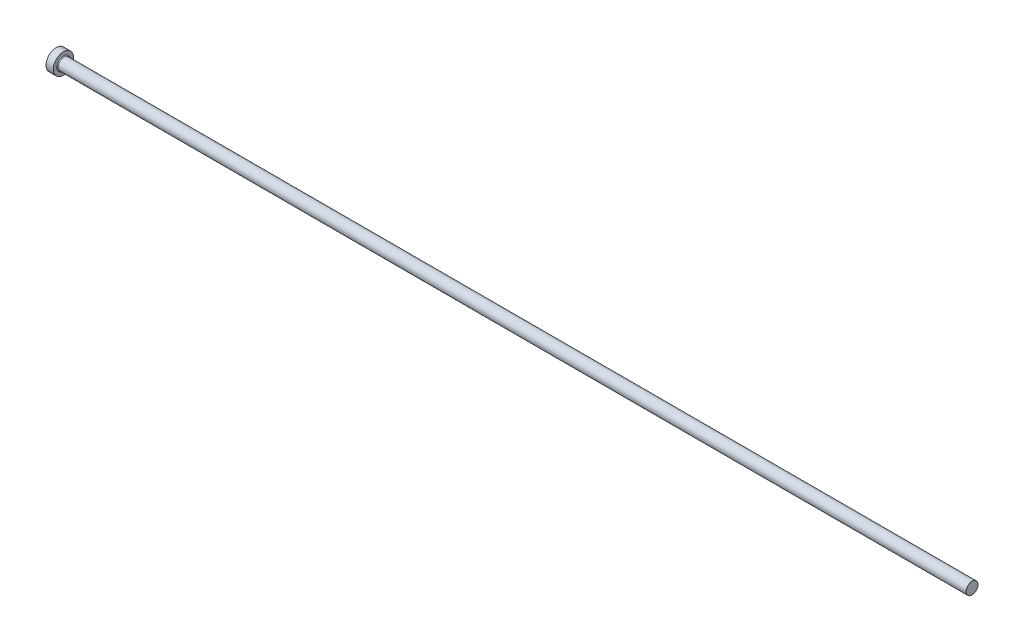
ISO-10303-21;
HEADER;
FILE_DESCRIPTION(('STEP AP214'),'2;1');
FILE_NAME('part.step','',(''),(''),'','','');
FILE_SCHEMA(('AUTOMOTIVE_DESIGN { 1 0 10303 214 1 1 1 1 }'));
ENDSEC;
DATA;
#1=APPLICATION_CONTEXT('core data for automotive mechanical design processes');
#2=APPLICATION_PROTOCOL_DEFINITION('international standard','automotive_design',2000,#1);
#3=PRODUCT_CONTEXT('',#1,'mechanical');
#4=PRODUCT('Part','Part','',(#3));
#5=PRODUCT_RELATED_PRODUCT_CATEGORY('part','',(#4));
#6=PRODUCT_DEFINITION_FORMATION('','',#4);
#7=PRODUCT_DEFINITION_CONTEXT('part definition',#1,'design');
#8=PRODUCT_DEFINITION('design','',#6,#7);
#9=PRODUCT_DEFINITION_SHAPE('','',#8);
#10=(LENGTH_UNIT() NAMED_UNIT(*) SI_UNIT(.MILLI.,.METRE.));
#11=(NAMED_UNIT(*) PLANE_ANGLE_UNIT() SI_UNIT($,.RADIAN.));
#12=(NAMED_UNIT(*) SI_UNIT($,.STERADIAN.) SOLID_ANGLE_UNIT());
#13=UNCERTAINTY_MEASURE_WITH_UNIT(LENGTH_MEASURE(1.E-05),#10,'distance_accuracy_value','');
#14=(GEOMETRIC_REPRESENTATION_CONTEXT(3) GLOBAL_UNCERTAINTY_ASSIGNED_CONTEXT((#13)) GLOBAL_UNIT_ASSIGNED_CONTEXT((#10,
#11,#12)) REPRESENTATION_CONTEXT('',''));
#15=CARTESIAN_POINT('',(0.,0.,0.));
#16=DIRECTION('',(0.,0.,1.));
#17=DIRECTION('',(1.,0.,0.));
#18=AXIS2_PLACEMENT_3D('',#15,#16,#17);
#19=CARTESIAN_POINT('',(0.,0.,0.));
#20=DIRECTION('',(-1.,0.,0.));
#21=DIRECTION('',(0.,-1.,0.));
#22=AXIS2_PLACEMENT_3D('',#19,#20,#21);
#23=PLANE('',#22);
#24=CARTESIAN_POINT('',(0.,0.,0.));
#25=DIRECTION('',(1.,0.,0.));
#26=DIRECTION('',(0.,1.,0.));
#27=AXIS2_PLACEMENT_3D('',#24,#25,#26);
#28=CIRCLE('',#27,7.);
#29=CARTESIAN_POINT('',(0.,7.,0.));
#30=VERTEX_POINT('',#29);
#31=EDGE_CURVE('E25',#30,#30,#28,.T.);
#32=ORIENTED_EDGE('',*,*,#31,.F.);
#33=EDGE_LOOP('',(#32));
#34=FACE_BOUND('',#33,.T.);
#35=ADVANCED_FACE('F14',(#34),#23,.T.);
#36=CARTESIAN_POINT('',(630.,0.,0.));
#37=DIRECTION('',(1.,0.,0.));
#38=DIRECTION('',(0.,1.,0.));
#39=AXIS2_PLACEMENT_3D('',#36,#37,#38);
#40=CYLINDRICAL_SURFACE('',#39,7.);
#41=ORIENTED_EDGE('',*,*,#31,.T.);
#42=EDGE_LOOP('',(#41));
#43=FACE_BOUND('',#42,.T.);
#44=CARTESIAN_POINT('',(5.,0.,0.));
#45=DIRECTION('',(1.,0.,0.));
#46=DIRECTION('',(0.,1.,0.));
#47=AXIS2_PLACEMENT_3D('',#44,#45,#46);
#48=CIRCLE('',#47,7.);
#49=CARTESIAN_POINT('',(5.,7.,0.));
#50=VERTEX_POINT('',#49);
#51=EDGE_CURVE('E29',#50,#50,#48,.T.);
#52=ORIENTED_EDGE('',*,*,#51,.F.);
#53=EDGE_LOOP('',(#52));
#54=FACE_BOUND('',#53,.T.);
#55=ADVANCED_FACE('F51',(#43,#54),#40,.T.);
#56=CARTESIAN_POINT('',(5.,7.,0.));
#57=DIRECTION('',(1.,0.,0.));
#58=DIRECTION('',(0.,1.,0.));
#59=AXIS2_PLACEMENT_3D('',#56,#57,#58);
#60=PLANE('',#59);
#61=CARTESIAN_POINT('',(5.,0.,0.));
#62=DIRECTION('',(1.,0.,0.));
#63=DIRECTION('',(0.,1.,0.));
#64=AXIS2_PLACEMENT_3D('',#61,#62,#63);
#65=CIRCLE('',#64,4.59999999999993);
#66=CARTESIAN_POINT('',(5.,4.59999999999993,0.));
#67=VERTEX_POINT('',#66);
#68=EDGE_CURVE('E9',#67,#67,#65,.F.);
#69=ORIENTED_EDGE('',*,*,#68,.T.);
#70=EDGE_LOOP('',(#69));
#71=FACE_BOUND('',#70,.T.);
#72=ORIENTED_EDGE('',*,*,#51,.T.);
#73=EDGE_LOOP('',(#72));
#74=FACE_BOUND('',#73,.T.);
#75=ADVANCED_FACE('F42',(#71,#74),#60,.T.);
#76=CARTESIAN_POINT('',(630.,0.,0.));
#77=DIRECTION('',(1.,0.,0.));
#78=DIRECTION('',(0.,1.,0.));
#79=AXIS2_PLACEMENT_3D('',#76,#77,#78);
#80=CYLINDRICAL_SURFACE('',#79,4.09999999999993);
#81=CARTESIAN_POINT('',(5.5,0.,0.));
#82=DIRECTION('',(1.,0.,0.));
#83=DIRECTION('',(0.,1.,0.));
#84=AXIS2_PLACEMENT_3D('',#81,#82,#83);
#85=CIRCLE('',#84,4.09999999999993);
#86=CARTESIAN_POINT('',(5.5,4.09999999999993,0.));
#87=VERTEX_POINT('',#86);
#88=EDGE_CURVE('E21',#87,#87,#85,.T.);
#89=ORIENTED_EDGE('',*,*,#88,.T.);
#90=EDGE_LOOP('',(#89));
#91=FACE_BOUND('',#90,.T.);
#92=CARTESIAN_POINT('',(630.,0.,0.));
#93=DIRECTION('',(1.,0.,0.));
#94=DIRECTION('',(0.,1.,0.));
#95=AXIS2_PLACEMENT_3D('',#92,#93,#94);
#96=CIRCLE('',#95,4.09999999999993);
#97=CARTESIAN_POINT('',(630.,4.09999999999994,0.));
#98=VERTEX_POINT('',#97);
#99=EDGE_CURVE('E34',#98,#98,#96,.T.);
#100=ORIENTED_EDGE('',*,*,#99,.F.);
#101=EDGE_LOOP('',(#100));
#102=FACE_BOUND('',#101,.T.);
#103=ADVANCED_FACE('F40',(#91,#102),#80,.T.);
#104=CARTESIAN_POINT('',(630.,4.09999999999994,0.));
#105=DIRECTION('',(1.,0.,0.));
#106=DIRECTION('',(0.,1.,0.));
#107=AXIS2_PLACEMENT_3D('',#104,#105,#106);
#108=PLANE('',#107);
#109=ORIENTED_EDGE('',*,*,#99,.T.);
#110=EDGE_LOOP('',(#109));
#111=FACE_BOUND('',#110,.T.);
#112=ADVANCED_FACE('F38',(#111),#108,.T.);
#113=CARTESIAN_POINT('',(5.5,0.,0.));
#114=DIRECTION('',(1.,0.,0.));
#115=DIRECTION('',(0.,1.,0.));
#116=AXIS2_PLACEMENT_3D('',#113,#114,#115);
#117=TOROIDAL_SURFACE('',#116,4.59999999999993,0.5);
#118=ORIENTED_EDGE('',*,*,#68,.F.);
#119=EDGE_LOOP('',(#118));
#120=FACE_BOUND('',#119,.T.);
#121=ORIENTED_EDGE('',*,*,#88,.F.);
#122=EDGE_LOOP('',(#121));
#123=FACE_BOUND('',#122,.T.);
#124=ADVANCED_FACE('F16',(#120,#123),#117,.F.);
#125=CLOSED_SHELL('',(#35,#55,#75,#103,#112,#124));
#126=MANIFOLD_SOLID_BREP('B1',#125);
#127=ADVANCED_BREP_SHAPE_REPRESENTATION('',(#18,#126),#14);
#128=SHAPE_DEFINITION_REPRESENTATION(#9,#127);
ENDSEC;
END-ISO-10303-21;
